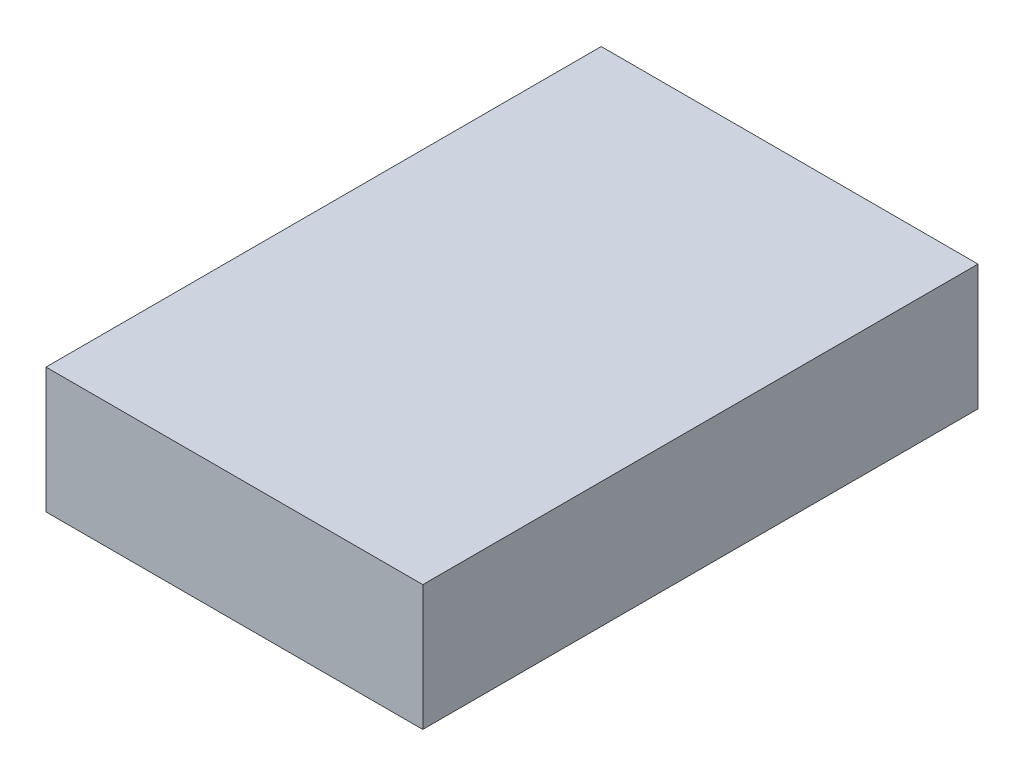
ISO-10303-21;
HEADER;
FILE_DESCRIPTION(('STEP AP214'),'2;1');
FILE_NAME('part.step','',(''),(''),'','','');
FILE_SCHEMA(('AUTOMOTIVE_DESIGN { 1 0 10303 214 1 1 1 1 }'));
ENDSEC;
DATA;
#1=APPLICATION_CONTEXT('core data for automotive mechanical design processes');
#2=APPLICATION_PROTOCOL_DEFINITION('international standard','automotive_design',2000,#1);
#3=PRODUCT_CONTEXT('',#1,'mechanical');
#4=PRODUCT('Part','Part','',(#3));
#5=PRODUCT_RELATED_PRODUCT_CATEGORY('part','',(#4));
#6=PRODUCT_DEFINITION_FORMATION('','',#4);
#7=PRODUCT_DEFINITION_CONTEXT('part definition',#1,'design');
#8=PRODUCT_DEFINITION('design','',#6,#7);
#9=PRODUCT_DEFINITION_SHAPE('','',#8);
#10=(LENGTH_UNIT() NAMED_UNIT(*) SI_UNIT(.MILLI.,.METRE.));
#11=(NAMED_UNIT(*) PLANE_ANGLE_UNIT() SI_UNIT($,.RADIAN.));
#12=(NAMED_UNIT(*) SI_UNIT($,.STERADIAN.) SOLID_ANGLE_UNIT());
#13=UNCERTAINTY_MEASURE_WITH_UNIT(LENGTH_MEASURE(1.E-05),#10,'distance_accuracy_value','');
#14=(GEOMETRIC_REPRESENTATION_CONTEXT(3) GLOBAL_UNCERTAINTY_ASSIGNED_CONTEXT((#13)) GLOBAL_UNIT_ASSIGNED_CONTEXT((#10,
#11,#12)) REPRESENTATION_CONTEXT('',''));
#15=CARTESIAN_POINT('',(0.,0.,0.));
#16=DIRECTION('',(0.,0.,1.));
#17=DIRECTION('',(1.,0.,0.));
#18=AXIS2_PLACEMENT_3D('',#15,#16,#17);
#19=CARTESIAN_POINT('',(0.,-72.5,-155.174551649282));
#20=DIRECTION('',(0.,-1.,0.));
#21=DIRECTION('',(0.,0.,-1.));
#22=AXIS2_PLACEMENT_3D('',#19,#20,#21);
#23=PLANE('',#22);
#24=DIRECTION('',(1.,0.,0.));
#25=VECTOR('',#24,1.);
#26=CARTESIAN_POINT('',(0.,-72.5,-155.174551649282));
#27=LINE('',#26,#25);
#28=CARTESIAN_POINT('',(-105.25,-72.5,-155.174551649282));
#29=VERTEX_POINT('',#28);
#30=CARTESIAN_POINT('',(105.25,-72.5,-155.174551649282));
#31=VERTEX_POINT('',#30);
#32=EDGE_CURVE('E68',#29,#31,#27,.T.);
#33=ORIENTED_EDGE('',*,*,#32,.T.);
#34=DIRECTION('',(0.,0.,-1.));
#35=VECTOR('',#34,1.);
#36=CARTESIAN_POINT('',(105.25,-72.5,-155.174551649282));
#37=LINE('',#36,#35);
#38=CARTESIAN_POINT('',(105.25,-72.5,155.));
#39=VERTEX_POINT('',#38);
#40=EDGE_CURVE('E55',#39,#31,#37,.T.);
#41=ORIENTED_EDGE('',*,*,#40,.F.);
#42=DIRECTION('',(1.,0.,0.));
#43=VECTOR('',#42,1.);
#44=CARTESIAN_POINT('',(0.,-72.5,155.));
#45=LINE('',#44,#43);
#46=CARTESIAN_POINT('',(-105.25,-72.5,155.));
#47=VERTEX_POINT('',#46);
#48=EDGE_CURVE('E20',#47,#39,#45,.T.);
#49=ORIENTED_EDGE('',*,*,#48,.F.);
#50=DIRECTION('',(0.,0.,1.));
#51=VECTOR('',#50,1.);
#52=CARTESIAN_POINT('',(-105.25,-72.5,-155.174551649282));
#53=LINE('',#52,#51);
#54=EDGE_CURVE('E81',#29,#47,#53,.T.);
#55=ORIENTED_EDGE('',*,*,#54,.F.);
#56=EDGE_LOOP('',(#33,#41,#49,#55));
#57=FACE_BOUND('',#56,.T.);
#58=ADVANCED_FACE('F17',(#57),#23,.T.);
#59=CARTESIAN_POINT('',(0.,-37.4563618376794,155.));
#60=DIRECTION('',(0.,0.,1.));
#61=DIRECTION('',(1.,0.,0.));
#62=AXIS2_PLACEMENT_3D('',#59,#60,#61);
#63=PLANE('',#62);
#64=DIRECTION('',(0.,1.,0.));
#65=VECTOR('',#64,1.);
#66=CARTESIAN_POINT('',(105.25,-37.4563618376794,155.));
#67=LINE('',#66,#65);
#68=CARTESIAN_POINT('',(105.25,-2.41272367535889,155.));
#69=VERTEX_POINT('',#68);
#70=EDGE_CURVE('E61',#69,#39,#67,.F.);
#71=ORIENTED_EDGE('',*,*,#70,.F.);
#72=DIRECTION('',(1.,0.,0.));
#73=VECTOR('',#72,1.);
#74=CARTESIAN_POINT('',(0.,-2.41272367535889,155.));
#75=LINE('',#74,#73);
#76=CARTESIAN_POINT('',(-105.25,-2.41272367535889,155.));
#77=VERTEX_POINT('',#76);
#78=EDGE_CURVE('E83',#77,#69,#75,.T.);
#79=ORIENTED_EDGE('',*,*,#78,.F.);
#80=DIRECTION('',(0.,1.,0.));
#81=VECTOR('',#80,1.);
#82=CARTESIAN_POINT('',(-105.25,-37.4563618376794,155.));
#83=LINE('',#82,#81);
#84=EDGE_CURVE('E64',#47,#77,#83,.T.);
#85=ORIENTED_EDGE('',*,*,#84,.F.);
#86=ORIENTED_EDGE('',*,*,#48,.T.);
#87=EDGE_LOOP('',(#71,#79,#85,#86));
#88=FACE_BOUND('',#87,.T.);
#89=ADVANCED_FACE('F60',(#88),#63,.T.);
#90=CARTESIAN_POINT('',(105.25,-37.4563618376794,-155.174551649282));
#91=DIRECTION('',(1.,0.,0.));
#92=DIRECTION('',(0.,0.,-1.));
#93=AXIS2_PLACEMENT_3D('',#90,#91,#92);
#94=PLANE('',#93);
#95=DIRECTION('',(0.,1.,0.));
#96=VECTOR('',#95,1.);
#97=CARTESIAN_POINT('',(105.25,-37.4563618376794,-155.174551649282));
#98=LINE('',#97,#96);
#99=CARTESIAN_POINT('',(105.25,-2.41272367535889,-155.174551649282));
#100=VERTEX_POINT('',#99);
#101=EDGE_CURVE('E70',#31,#100,#98,.T.);
#102=ORIENTED_EDGE('',*,*,#101,.T.);
#103=DIRECTION('',(0.,0.,1.));
#104=VECTOR('',#103,1.);
#105=CARTESIAN_POINT('',(105.25,-2.41272367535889,-155.174551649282));
#106=LINE('',#105,#104);
#107=EDGE_CURVE('E74',#69,#100,#106,.F.);
#108=ORIENTED_EDGE('',*,*,#107,.F.);
#109=ORIENTED_EDGE('',*,*,#70,.T.);
#110=ORIENTED_EDGE('',*,*,#40,.T.);
#111=EDGE_LOOP('',(#102,#108,#109,#110));
#112=FACE_BOUND('',#111,.T.);
#113=ADVANCED_FACE('F72',(#112),#94,.T.);
#114=CARTESIAN_POINT('',(0.,-37.4563618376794,-155.174551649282));
#115=DIRECTION('',(0.,0.,1.));
#116=DIRECTION('',(1.,0.,0.));
#117=AXIS2_PLACEMENT_3D('',#114,#115,#116);
#118=PLANE('',#117);
#119=DIRECTION('',(0.,1.,0.));
#120=VECTOR('',#119,1.);
#121=CARTESIAN_POINT('',(-105.25,-37.4563618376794,-155.174551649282));
#122=LINE('',#121,#120);
#123=CARTESIAN_POINT('',(-105.25,-2.41272367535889,-155.174551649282));
#124=VERTEX_POINT('',#123);
#125=EDGE_CURVE('E35',#124,#29,#122,.F.);
#126=ORIENTED_EDGE('',*,*,#125,.F.);
#127=DIRECTION('',(1.,0.,0.));
#128=VECTOR('',#127,1.);
#129=CARTESIAN_POINT('',(0.,-2.41272367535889,-155.174551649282));
#130=LINE('',#129,#128);
#131=EDGE_CURVE('E26',#100,#124,#130,.F.);
#132=ORIENTED_EDGE('',*,*,#131,.F.);
#133=ORIENTED_EDGE('',*,*,#101,.F.);
#134=ORIENTED_EDGE('',*,*,#32,.F.);
#135=EDGE_LOOP('',(#126,#132,#133,#134));
#136=FACE_BOUND('',#135,.T.);
#137=ADVANCED_FACE('F89',(#136),#118,.F.);
#138=CARTESIAN_POINT('',(-105.25,-37.4563618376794,-155.174551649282));
#139=DIRECTION('',(-1.,0.,0.));
#140=DIRECTION('',(0.,0.,1.));
#141=AXIS2_PLACEMENT_3D('',#138,#139,#140);
#142=PLANE('',#141);
#143=ORIENTED_EDGE('',*,*,#125,.T.);
#144=ORIENTED_EDGE('',*,*,#54,.T.);
#145=ORIENTED_EDGE('',*,*,#84,.T.);
#146=DIRECTION('',(0.,0.,1.));
#147=VECTOR('',#146,1.);
#148=CARTESIAN_POINT('',(-105.25,-2.41272367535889,-155.174551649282));
#149=LINE('',#148,#147);
#150=EDGE_CURVE('E11',#124,#77,#149,.T.);
#151=ORIENTED_EDGE('',*,*,#150,.F.);
#152=EDGE_LOOP('',(#143,#144,#145,#151));
#153=FACE_BOUND('',#152,.T.);
#154=ADVANCED_FACE('F91',(#153),#142,.T.);
#155=CARTESIAN_POINT('',(0.,-2.41272367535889,-155.174551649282));
#156=DIRECTION('',(0.,1.,0.));
#157=DIRECTION('',(0.,0.,1.));
#158=AXIS2_PLACEMENT_3D('',#155,#156,#157);
#159=PLANE('',#158);
#160=ORIENTED_EDGE('',*,*,#131,.T.);
#161=ORIENTED_EDGE('',*,*,#150,.T.);
#162=ORIENTED_EDGE('',*,*,#78,.T.);
#163=ORIENTED_EDGE('',*,*,#107,.T.);
#164=EDGE_LOOP('',(#160,#161,#162,#163));
#165=FACE_BOUND('',#164,.T.);
#166=ADVANCED_FACE('F88',(#165),#159,.T.);
#167=CLOSED_SHELL('',(#58,#89,#113,#137,#154,#166));
#168=MANIFOLD_SOLID_BREP('B1',#167);
#169=ADVANCED_BREP_SHAPE_REPRESENTATION('',(#18,#168),#14);
#170=SHAPE_DEFINITION_REPRESENTATION(#9,#169);
ENDSEC;
END-ISO-10303-21;
